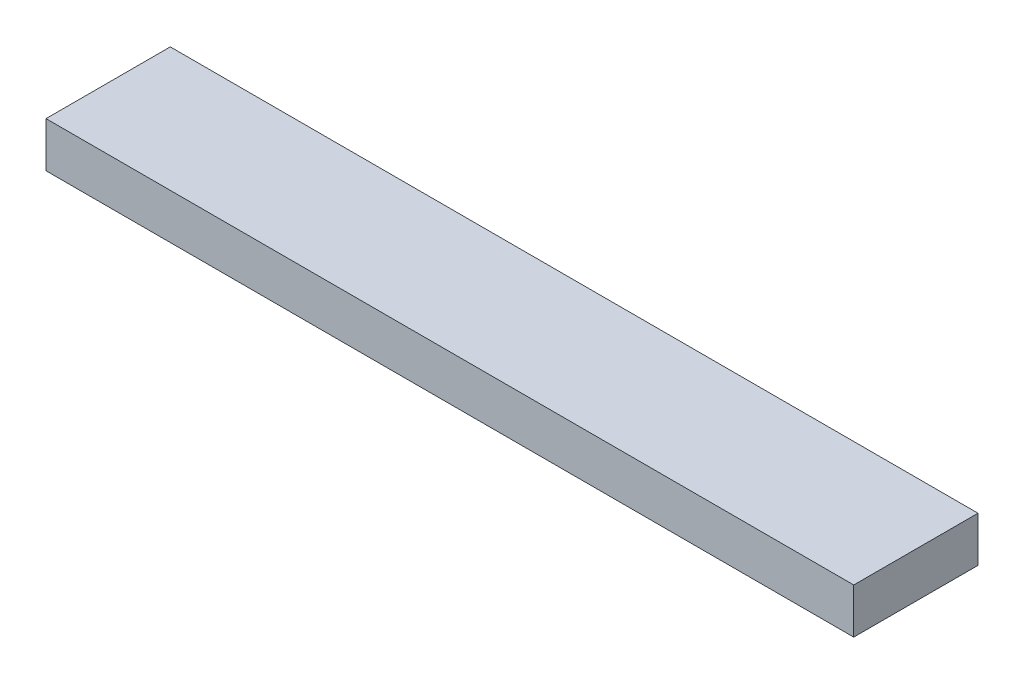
ISO-10303-21;
HEADER;
FILE_DESCRIPTION(('STEP AP214'),'2;1');
FILE_NAME('part.step','',(''),(''),'','','');
FILE_SCHEMA(('AUTOMOTIVE_DESIGN { 1 0 10303 214 1 1 1 1 }'));
ENDSEC;
DATA;
#1=APPLICATION_CONTEXT('core data for automotive mechanical design processes');
#2=APPLICATION_PROTOCOL_DEFINITION('international standard','automotive_design',2000,#1);
#3=PRODUCT_CONTEXT('',#1,'mechanical');
#4=PRODUCT('Part','Part','',(#3));
#5=PRODUCT_RELATED_PRODUCT_CATEGORY('part','',(#4));
#6=PRODUCT_DEFINITION_FORMATION('','',#4);
#7=PRODUCT_DEFINITION_CONTEXT('part definition',#1,'design');
#8=PRODUCT_DEFINITION('design','',#6,#7);
#9=PRODUCT_DEFINITION_SHAPE('','',#8);
#10=(LENGTH_UNIT() NAMED_UNIT(*) SI_UNIT(.MILLI.,.METRE.));
#11=(NAMED_UNIT(*) PLANE_ANGLE_UNIT() SI_UNIT($,.RADIAN.));
#12=(NAMED_UNIT(*) SI_UNIT($,.STERADIAN.) SOLID_ANGLE_UNIT());
#13=UNCERTAINTY_MEASURE_WITH_UNIT(LENGTH_MEASURE(1.E-05),#10,'distance_accuracy_value','');
#14=(GEOMETRIC_REPRESENTATION_CONTEXT(3) GLOBAL_UNCERTAINTY_ASSIGNED_CONTEXT((#13)) GLOBAL_UNIT_ASSIGNED_CONTEXT((#10,
#11,#12)) REPRESENTATION_CONTEXT('',''));
#15=CARTESIAN_POINT('',(0.,0.,0.));
#16=DIRECTION('',(0.,0.,1.));
#17=DIRECTION('',(1.,0.,0.));
#18=AXIS2_PLACEMENT_3D('',#15,#16,#17);
#19=CARTESIAN_POINT('',(227.0125,12.7,-34.925));
#20=DIRECTION('',(0.,0.,1.));
#21=DIRECTION('',(1.,0.,0.));
#22=AXIS2_PLACEMENT_3D('',#19,#20,#21);
#23=PLANE('',#22);
#24=DIRECTION('',(0.,1.,0.));
#25=VECTOR('',#24,1.);
#26=CARTESIAN_POINT('',(-227.0125,12.7,-34.925));
#27=LINE('',#26,#25);
#28=CARTESIAN_POINT('',(-227.0125,-12.7,-34.925));
#29=VERTEX_POINT('',#28);
#30=CARTESIAN_POINT('',(-227.0125,12.7,-34.925));
#31=VERTEX_POINT('',#30);
#32=EDGE_CURVE('E95',#29,#31,#27,.T.);
#33=ORIENTED_EDGE('',*,*,#32,.T.);
#34=DIRECTION('',(-1.,0.,0.));
#35=VECTOR('',#34,1.);
#36=CARTESIAN_POINT('',(227.0125,12.7,-34.925));
#37=LINE('',#36,#35);
#38=CARTESIAN_POINT('',(227.0125,12.7,-34.925));
#39=VERTEX_POINT('',#38);
#40=EDGE_CURVE('E11',#39,#31,#37,.T.);
#41=ORIENTED_EDGE('',*,*,#40,.F.);
#42=DIRECTION('',(0.,1.,0.));
#43=VECTOR('',#42,1.);
#44=CARTESIAN_POINT('',(227.0125,12.7,-34.925));
#45=LINE('',#44,#43);
#46=CARTESIAN_POINT('',(227.0125,-12.7,-34.925));
#47=VERTEX_POINT('',#46);
#48=EDGE_CURVE('E83',#47,#39,#45,.T.);
#49=ORIENTED_EDGE('',*,*,#48,.F.);
#50=DIRECTION('',(-1.,0.,0.));
#51=VECTOR('',#50,1.);
#52=CARTESIAN_POINT('',(227.0125,-12.7,-34.925));
#53=LINE('',#52,#51);
#54=EDGE_CURVE('E91',#47,#29,#53,.T.);
#55=ORIENTED_EDGE('',*,*,#54,.T.);
#56=EDGE_LOOP('',(#33,#41,#49,#55));
#57=FACE_BOUND('',#56,.T.);
#58=ADVANCED_FACE('F32',(#57),#23,.F.);
#59=CARTESIAN_POINT('',(227.0125,12.7,34.925));
#60=DIRECTION('',(0.,-1.,0.));
#61=DIRECTION('',(0.,0.,-1.));
#62=AXIS2_PLACEMENT_3D('',#59,#60,#61);
#63=PLANE('',#62);
#64=DIRECTION('',(0.,0.,1.));
#65=VECTOR('',#64,1.);
#66=CARTESIAN_POINT('',(-227.0125,12.7,34.925));
#67=LINE('',#66,#65);
#68=CARTESIAN_POINT('',(-227.0125,12.7,34.925));
#69=VERTEX_POINT('',#68);
#70=EDGE_CURVE('E87',#31,#69,#67,.T.);
#71=ORIENTED_EDGE('',*,*,#70,.T.);
#72=DIRECTION('',(-1.,0.,0.));
#73=VECTOR('',#72,1.);
#74=CARTESIAN_POINT('',(227.0125,12.7,34.925));
#75=LINE('',#74,#73);
#76=CARTESIAN_POINT('',(227.0125,12.7,34.925));
#77=VERTEX_POINT('',#76);
#78=EDGE_CURVE('E40',#77,#69,#75,.T.);
#79=ORIENTED_EDGE('',*,*,#78,.F.);
#80=DIRECTION('',(0.,0.,1.));
#81=VECTOR('',#80,1.);
#82=CARTESIAN_POINT('',(227.0125,12.7,34.925));
#83=LINE('',#82,#81);
#84=EDGE_CURVE('E78',#39,#77,#83,.T.);
#85=ORIENTED_EDGE('',*,*,#84,.F.);
#86=ORIENTED_EDGE('',*,*,#40,.T.);
#87=EDGE_LOOP('',(#71,#79,#85,#86));
#88=FACE_BOUND('',#87,.T.);
#89=ADVANCED_FACE('F86',(#88),#63,.F.);
#90=CARTESIAN_POINT('',(227.0125,12.7,34.925));
#91=DIRECTION('',(0.,0.,-1.));
#92=DIRECTION('',(-1.,0.,0.));
#93=AXIS2_PLACEMENT_3D('',#90,#91,#92);
#94=PLANE('',#93);
#95=DIRECTION('',(0.,-1.,0.));
#96=VECTOR('',#95,1.);
#97=CARTESIAN_POINT('',(-227.0125,12.7,34.925));
#98=LINE('',#97,#96);
#99=CARTESIAN_POINT('',(-227.0125,-12.7,34.925));
#100=VERTEX_POINT('',#99);
#101=EDGE_CURVE('E65',#69,#100,#98,.T.);
#102=ORIENTED_EDGE('',*,*,#101,.T.);
#103=DIRECTION('',(-1.,0.,0.));
#104=VECTOR('',#103,1.);
#105=CARTESIAN_POINT('',(227.0125,-12.7,34.925));
#106=LINE('',#105,#104);
#107=CARTESIAN_POINT('',(227.0125,-12.7,34.925));
#108=VERTEX_POINT('',#107);
#109=EDGE_CURVE('E88',#108,#100,#106,.T.);
#110=ORIENTED_EDGE('',*,*,#109,.F.);
#111=DIRECTION('',(0.,-1.,0.));
#112=VECTOR('',#111,1.);
#113=CARTESIAN_POINT('',(227.0125,12.7,34.925));
#114=LINE('',#113,#112);
#115=EDGE_CURVE('E81',#77,#108,#114,.T.);
#116=ORIENTED_EDGE('',*,*,#115,.F.);
#117=ORIENTED_EDGE('',*,*,#78,.T.);
#118=EDGE_LOOP('',(#102,#110,#116,#117));
#119=FACE_BOUND('',#118,.T.);
#120=ADVANCED_FACE('F89',(#119),#94,.F.);
#121=CARTESIAN_POINT('',(227.0125,-12.7,34.925));
#122=DIRECTION('',(0.,1.,0.));
#123=DIRECTION('',(0.,0.,1.));
#124=AXIS2_PLACEMENT_3D('',#121,#122,#123);
#125=PLANE('',#124);
#126=DIRECTION('',(0.,0.,-1.));
#127=VECTOR('',#126,1.);
#128=CARTESIAN_POINT('',(-227.0125,-12.7,34.925));
#129=LINE('',#128,#127);
#130=EDGE_CURVE('E71',#100,#29,#129,.T.);
#131=ORIENTED_EDGE('',*,*,#130,.T.);
#132=ORIENTED_EDGE('',*,*,#54,.F.);
#133=DIRECTION('',(0.,0.,-1.));
#134=VECTOR('',#133,1.);
#135=CARTESIAN_POINT('',(227.0125,-12.7,34.925));
#136=LINE('',#135,#134);
#137=EDGE_CURVE('E48',#108,#47,#136,.T.);
#138=ORIENTED_EDGE('',*,*,#137,.F.);
#139=ORIENTED_EDGE('',*,*,#109,.T.);
#140=EDGE_LOOP('',(#131,#132,#138,#139));
#141=FACE_BOUND('',#140,.T.);
#142=ADVANCED_FACE('F102',(#141),#125,.F.);
#143=CARTESIAN_POINT('',(227.0125,0.,0.));
#144=DIRECTION('',(1.,0.,0.));
#145=DIRECTION('',(0.,0.,-1.));
#146=AXIS2_PLACEMENT_3D('',#143,#144,#145);
#147=PLANE('',#146);
#148=ORIENTED_EDGE('',*,*,#48,.T.);
#149=ORIENTED_EDGE('',*,*,#84,.T.);
#150=ORIENTED_EDGE('',*,*,#115,.T.);
#151=ORIENTED_EDGE('',*,*,#137,.T.);
#152=EDGE_LOOP('',(#148,#149,#150,#151));
#153=FACE_BOUND('',#152,.T.);
#154=ADVANCED_FACE('F79',(#153),#147,.T.);
#155=CARTESIAN_POINT('',(-227.0125,0.,0.));
#156=DIRECTION('',(1.,0.,0.));
#157=DIRECTION('',(0.,0.,-1.));
#158=AXIS2_PLACEMENT_3D('',#155,#156,#157);
#159=PLANE('',#158);
#160=ORIENTED_EDGE('',*,*,#32,.F.);
#161=ORIENTED_EDGE('',*,*,#130,.F.);
#162=ORIENTED_EDGE('',*,*,#101,.F.);
#163=ORIENTED_EDGE('',*,*,#70,.F.);
#164=EDGE_LOOP('',(#160,#161,#162,#163));
#165=FACE_BOUND('',#164,.T.);
#166=ADVANCED_FACE('F105',(#165),#159,.F.);
#167=CLOSED_SHELL('',(#58,#89,#120,#142,#154,#166));
#168=MANIFOLD_SOLID_BREP('B2',#167);
#169=ADVANCED_BREP_SHAPE_REPRESENTATION('',(#18,#168),#14);
#170=SHAPE_DEFINITION_REPRESENTATION(#9,#169);
ENDSEC;
END-ISO-10303-21;
